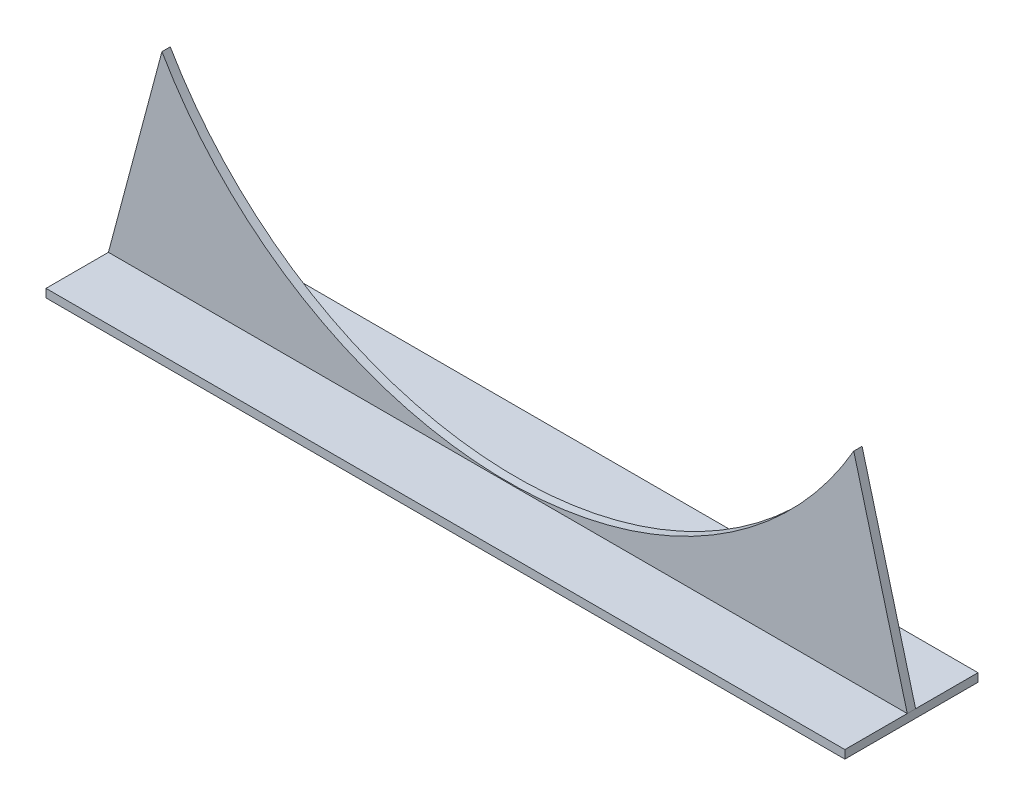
from build123d import *

# Parameters (mm, degrees)
BOSS_EXTRUDE1_DEPTH = 6.35
SKETCH2_W           = 203.2
SKETCH2_H           = 12.7
BOSS_EXTRUDE2_DEPTH = 609.6


with BuildPart() as part:
    # Sketch1 → Boss-Extrude1 (new, symmetric)
    with BuildSketch(Plane.XY):
        with BuildLine():
            Line((-527.929086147, -304.8), (-609.6, -610.87))
            Line((-609.6, -610.87), (609.6, -610.87))
            Line((609.6, -610.87), (527.929086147, -304.8))
            ThreePointArc((527.929086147, -304.8), (0, -609.6), (-527.929086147, -304.8))
        make_face()
    extrude(amount=BOSS_EXTRUDE1_DEPTH, both=True)

    # Sketch2 → Boss-Extrude2 (add, symmetric)
    with BuildSketch(Plane(origin=(0, 0, 0), x_dir=(0, 0, -1), z_dir=(1, 0, 0))):
        with Locations((0, -617.22)):
            Rectangle(SKETCH2_W, SKETCH2_H)
    extrude(amount=BOSS_EXTRUDE2_DEPTH, both=True)


solid = part.part
